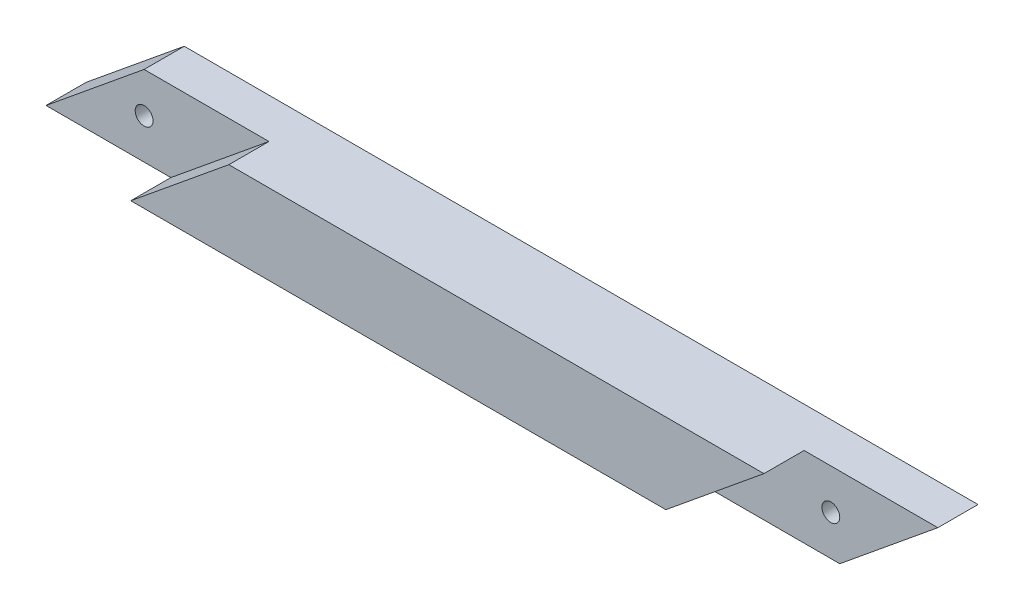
ISO-10303-21;
HEADER;
FILE_DESCRIPTION(('STEP AP214'),'2;1');
FILE_NAME('part.step','',(''),(''),'','','');
FILE_SCHEMA(('AUTOMOTIVE_DESIGN { 1 0 10303 214 1 1 1 1 }'));
ENDSEC;
DATA;
#1=APPLICATION_CONTEXT('core data for automotive mechanical design processes');
#2=APPLICATION_PROTOCOL_DEFINITION('international standard','automotive_design',2000,#1);
#3=PRODUCT_CONTEXT('',#1,'mechanical');
#4=PRODUCT('Part','Part','',(#3));
#5=PRODUCT_RELATED_PRODUCT_CATEGORY('part','',(#4));
#6=PRODUCT_DEFINITION_FORMATION('','',#4);
#7=PRODUCT_DEFINITION_CONTEXT('part definition',#1,'design');
#8=PRODUCT_DEFINITION('design','',#6,#7);
#9=PRODUCT_DEFINITION_SHAPE('','',#8);
#10=(LENGTH_UNIT() NAMED_UNIT(*) SI_UNIT(.MILLI.,.METRE.));
#11=(NAMED_UNIT(*) PLANE_ANGLE_UNIT() SI_UNIT($,.RADIAN.));
#12=(NAMED_UNIT(*) SI_UNIT($,.STERADIAN.) SOLID_ANGLE_UNIT());
#13=UNCERTAINTY_MEASURE_WITH_UNIT(LENGTH_MEASURE(1.E-05),#10,'distance_accuracy_value','');
#14=(GEOMETRIC_REPRESENTATION_CONTEXT(3) GLOBAL_UNCERTAINTY_ASSIGNED_CONTEXT((#13)) GLOBAL_UNIT_ASSIGNED_CONTEXT((#10,
#11,#12)) REPRESENTATION_CONTEXT('',''));
#15=CARTESIAN_POINT('',(0.,0.,0.));
#16=DIRECTION('',(0.,0.,1.));
#17=DIRECTION('',(1.,0.,0.));
#18=AXIS2_PLACEMENT_3D('',#15,#16,#17);
#19=CARTESIAN_POINT('',(100.,9.,0.));
#20=DIRECTION('',(-0.633237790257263,0.773957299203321,0.));
#21=DIRECTION('',(-0.773957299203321,-0.633237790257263,0.));
#22=AXIS2_PLACEMENT_3D('',#19,#20,#21);
#23=PLANE('',#22);
#24=DIRECTION('',(0.773957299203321,0.633237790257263,0.));
#25=VECTOR('',#24,1.);
#26=CARTESIAN_POINT('',(89.,0.,4.5));
#27=LINE('',#26,#25);
#28=CARTESIAN_POINT('',(89.,0.,4.5));
#29=VERTEX_POINT('',#28);
#30=CARTESIAN_POINT('',(100.,9.,4.5));
#31=VERTEX_POINT('',#30);
#32=EDGE_CURVE('E95',#29,#31,#27,.T.);
#33=ORIENTED_EDGE('',*,*,#32,.F.);
#34=DIRECTION('',(0.,0.,1.));
#35=VECTOR('',#34,1.);
#36=CARTESIAN_POINT('',(89.,0.,0.));
#37=LINE('',#36,#35);
#38=CARTESIAN_POINT('',(89.,0.,0.));
#39=VERTEX_POINT('',#38);
#40=EDGE_CURVE('E153',#39,#29,#37,.T.);
#41=ORIENTED_EDGE('',*,*,#40,.F.);
#42=DIRECTION('',(-0.773957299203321,-0.633237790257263,0.));
#43=VECTOR('',#42,1.);
#44=CARTESIAN_POINT('',(100.,9.,0.));
#45=LINE('',#44,#43);
#46=CARTESIAN_POINT('',(100.,9.,0.));
#47=VERTEX_POINT('',#46);
#48=EDGE_CURVE('E114',#47,#39,#45,.T.);
#49=ORIENTED_EDGE('',*,*,#48,.F.);
#50=DIRECTION('',(0.,0.,-1.));
#51=VECTOR('',#50,1.);
#52=CARTESIAN_POINT('',(100.,9.,9.));
#53=LINE('',#52,#51);
#54=EDGE_CURVE('E39',#31,#47,#53,.T.);
#55=ORIENTED_EDGE('',*,*,#54,.F.);
#56=EDGE_LOOP('',(#33,#41,#49,#55));
#57=FACE_BOUND('',#56,.T.);
#58=ADVANCED_FACE('F31',(#57),#23,.F.);
#59=CARTESIAN_POINT('',(0.,9.,9.));
#60=DIRECTION('',(0.,-1.,0.));
#61=DIRECTION('',(0.,0.,-1.));
#62=AXIS2_PLACEMENT_3D('',#59,#60,#61);
#63=PLANE('',#62);
#64=DIRECTION('',(-1.,0.,0.));
#65=VECTOR('',#64,1.);
#66=CARTESIAN_POINT('',(0.,9.,9.));
#67=LINE('',#66,#65);
#68=CARTESIAN_POINT('',(85.,9.,9.));
#69=VERTEX_POINT('',#68);
#70=CARTESIAN_POINT('',(25.,9.,9.));
#71=VERTEX_POINT('',#70);
#72=EDGE_CURVE('E116',#69,#71,#67,.T.);
#73=ORIENTED_EDGE('',*,*,#72,.F.);
#74=DIRECTION('',(0.,0.,1.));
#75=VECTOR('',#74,1.);
#76=CARTESIAN_POINT('',(85.,9.,4.5));
#77=LINE('',#76,#75);
#78=CARTESIAN_POINT('',(85.,9.,4.5));
#79=VERTEX_POINT('',#78);
#80=EDGE_CURVE('E110',#79,#69,#77,.T.);
#81=ORIENTED_EDGE('',*,*,#80,.F.);
#82=DIRECTION('',(-1.,0.,0.));
#83=VECTOR('',#82,1.);
#84=CARTESIAN_POINT('',(100.,9.,4.5));
#85=LINE('',#84,#83);
#86=EDGE_CURVE('E98',#31,#79,#85,.T.);
#87=ORIENTED_EDGE('',*,*,#86,.F.);
#88=ORIENTED_EDGE('',*,*,#54,.T.);
#89=DIRECTION('',(-1.,0.,0.));
#90=VECTOR('',#89,1.);
#91=CARTESIAN_POINT('',(0.,9.,0.));
#92=LINE('',#91,#90);
#93=CARTESIAN_POINT('',(11.,9.,0.));
#94=VERTEX_POINT('',#93);
#95=EDGE_CURVE('E120',#47,#94,#92,.T.);
#96=ORIENTED_EDGE('',*,*,#95,.T.);
#97=DIRECTION('',(0.,0.,1.));
#98=VECTOR('',#97,1.);
#99=CARTESIAN_POINT('',(11.,9.,0.));
#100=LINE('',#99,#98);
#101=CARTESIAN_POINT('',(11.,9.,4.5));
#102=VERTEX_POINT('',#101);
#103=EDGE_CURVE('E124',#94,#102,#100,.T.);
#104=ORIENTED_EDGE('',*,*,#103,.T.);
#105=DIRECTION('',(-1.,0.,0.));
#106=VECTOR('',#105,1.);
#107=CARTESIAN_POINT('',(11.,9.,4.5));
#108=LINE('',#107,#106);
#109=CARTESIAN_POINT('',(25.,9.,4.5));
#110=VERTEX_POINT('',#109);
#111=EDGE_CURVE('E54',#110,#102,#108,.T.);
#112=ORIENTED_EDGE('',*,*,#111,.F.);
#113=DIRECTION('',(0.,0.,1.));
#114=VECTOR('',#113,1.);
#115=CARTESIAN_POINT('',(25.,9.,4.5));
#116=LINE('',#115,#114);
#117=EDGE_CURVE('E133',#110,#71,#116,.T.);
#118=ORIENTED_EDGE('',*,*,#117,.T.);
#119=EDGE_LOOP('',(#73,#81,#87,#88,#96,#104,#112,#118));
#120=FACE_BOUND('',#119,.T.);
#121=ADVANCED_FACE('F107',(#120),#63,.F.);
#122=CARTESIAN_POINT('',(0.,9.,9.));
#123=DIRECTION('',(0.,0.,-1.));
#124=DIRECTION('',(-1.,0.,0.));
#125=AXIS2_PLACEMENT_3D('',#122,#123,#124);
#126=PLANE('',#125);
#127=DIRECTION('',(1.,0.,0.));
#128=VECTOR('',#127,1.);
#129=CARTESIAN_POINT('',(0.,0.,9.));
#130=LINE('',#129,#128);
#131=CARTESIAN_POINT('',(14.,0.,9.));
#132=VERTEX_POINT('',#131);
#133=CARTESIAN_POINT('',(74.,0.,9.));
#134=VERTEX_POINT('',#133);
#135=EDGE_CURVE('E117',#132,#134,#130,.T.);
#136=ORIENTED_EDGE('',*,*,#135,.T.);
#137=DIRECTION('',(-0.773957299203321,-0.633237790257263,0.));
#138=VECTOR('',#137,1.);
#139=CARTESIAN_POINT('',(85.,9.,9.));
#140=LINE('',#139,#138);
#141=EDGE_CURVE('E103',#69,#134,#140,.T.);
#142=ORIENTED_EDGE('',*,*,#141,.F.);
#143=ORIENTED_EDGE('',*,*,#72,.T.);
#144=DIRECTION('',(0.773957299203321,0.633237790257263,0.));
#145=VECTOR('',#144,1.);
#146=CARTESIAN_POINT('',(25.,9.,9.));
#147=LINE('',#146,#145);
#148=EDGE_CURVE('E138',#132,#71,#147,.T.);
#149=ORIENTED_EDGE('',*,*,#148,.F.);
#150=EDGE_LOOP('',(#136,#142,#143,#149));
#151=FACE_BOUND('',#150,.T.);
#152=ADVANCED_FACE('F195',(#151),#126,.F.);
#153=CARTESIAN_POINT('',(0.,9.,0.));
#154=DIRECTION('',(0.,0.,-1.));
#155=DIRECTION('',(-1.,0.,0.));
#156=AXIS2_PLACEMENT_3D('',#153,#154,#155);
#157=PLANE('',#156);
#158=CARTESIAN_POINT('',(88.,4.5,0.));
#159=DIRECTION('',(0.,0.,1.));
#160=DIRECTION('',(1.,0.,0.));
#161=AXIS2_PLACEMENT_3D('',#158,#159,#160);
#162=CIRCLE('',#161,0.999999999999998);
#163=CARTESIAN_POINT('',(89.,4.5,0.));
#164=VERTEX_POINT('',#163);
#165=EDGE_CURVE('E163',#164,#164,#162,.T.);
#166=ORIENTED_EDGE('',*,*,#165,.T.);
#167=EDGE_LOOP('',(#166));
#168=FACE_BOUND('',#167,.T.);
#169=ORIENTED_EDGE('',*,*,#48,.T.);
#170=DIRECTION('',(1.,0.,0.));
#171=VECTOR('',#170,1.);
#172=CARTESIAN_POINT('',(0.,0.,0.));
#173=LINE('',#172,#171);
#174=CARTESIAN_POINT('',(0.,0.,0.));
#175=VERTEX_POINT('',#174);
#176=EDGE_CURVE('E122',#175,#39,#173,.T.);
#177=ORIENTED_EDGE('',*,*,#176,.F.);
#178=DIRECTION('',(-0.773957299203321,-0.633237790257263,0.));
#179=VECTOR('',#178,1.);
#180=CARTESIAN_POINT('',(-34.480988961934,-28.2117182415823,0.));
#181=LINE('',#180,#179);
#182=EDGE_CURVE('E130',#94,#175,#181,.T.);
#183=ORIENTED_EDGE('',*,*,#182,.F.);
#184=ORIENTED_EDGE('',*,*,#95,.F.);
#185=EDGE_LOOP('',(#169,#177,#183,#184));
#186=FACE_BOUND('',#185,.T.);
#187=CARTESIAN_POINT('',(11.,4.5,0.));
#188=DIRECTION('',(0.,0.,1.));
#189=DIRECTION('',(1.,0.,0.));
#190=AXIS2_PLACEMENT_3D('',#187,#188,#189);
#191=CIRCLE('',#190,1.);
#192=CARTESIAN_POINT('',(12.,4.5,0.));
#193=VERTEX_POINT('',#192);
#194=EDGE_CURVE('E142',#193,#193,#191,.T.);
#195=ORIENTED_EDGE('',*,*,#194,.T.);
#196=EDGE_LOOP('',(#195));
#197=FACE_BOUND('',#196,.T.);
#198=ADVANCED_FACE('F172',(#168,#186,#197),#157,.T.);
#199=CARTESIAN_POINT('',(0.,0.,9.));
#200=DIRECTION('',(0.,1.,0.));
#201=DIRECTION('',(0.,0.,1.));
#202=AXIS2_PLACEMENT_3D('',#199,#200,#201);
#203=PLANE('',#202);
#204=DIRECTION('',(1.,0.,0.));
#205=VECTOR('',#204,1.);
#206=CARTESIAN_POINT('',(74.,0.,4.5));
#207=LINE('',#206,#205);
#208=CARTESIAN_POINT('',(74.,0.,4.5));
#209=VERTEX_POINT('',#208);
#210=EDGE_CURVE('E46',#209,#29,#207,.T.);
#211=ORIENTED_EDGE('',*,*,#210,.F.);
#212=DIRECTION('',(0.,0.,1.));
#213=VECTOR('',#212,1.);
#214=CARTESIAN_POINT('',(74.,0.,4.5));
#215=LINE('',#214,#213);
#216=EDGE_CURVE('E158',#209,#134,#215,.T.);
#217=ORIENTED_EDGE('',*,*,#216,.T.);
#218=ORIENTED_EDGE('',*,*,#135,.F.);
#219=DIRECTION('',(0.,0.,1.));
#220=VECTOR('',#219,1.);
#221=CARTESIAN_POINT('',(14.,0.,4.5));
#222=LINE('',#221,#220);
#223=CARTESIAN_POINT('',(14.,0.,4.5));
#224=VERTEX_POINT('',#223);
#225=EDGE_CURVE('E134',#224,#132,#222,.T.);
#226=ORIENTED_EDGE('',*,*,#225,.F.);
#227=DIRECTION('',(1.,0.,0.));
#228=VECTOR('',#227,1.);
#229=CARTESIAN_POINT('',(14.,0.,4.5));
#230=LINE('',#229,#228);
#231=CARTESIAN_POINT('',(0.,0.,4.5));
#232=VERTEX_POINT('',#231);
#233=EDGE_CURVE('E146',#232,#224,#230,.T.);
#234=ORIENTED_EDGE('',*,*,#233,.F.);
#235=DIRECTION('',(0.,0.,-1.));
#236=VECTOR('',#235,1.);
#237=CARTESIAN_POINT('',(0.,0.,9.));
#238=LINE('',#237,#236);
#239=EDGE_CURVE('E11',#232,#175,#238,.T.);
#240=ORIENTED_EDGE('',*,*,#239,.T.);
#241=ORIENTED_EDGE('',*,*,#176,.T.);
#242=ORIENTED_EDGE('',*,*,#40,.T.);
#243=EDGE_LOOP('',(#211,#217,#218,#226,#234,#240,#241,#242));
#244=FACE_BOUND('',#243,.T.);
#245=ADVANCED_FACE('F33',(#244),#203,.F.);
#246=CARTESIAN_POINT('',(-34.480988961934,-28.2117182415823,0.));
#247=DIRECTION('',(-0.633237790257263,0.773957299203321,0.));
#248=DIRECTION('',(-0.773957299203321,-0.633237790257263,0.));
#249=AXIS2_PLACEMENT_3D('',#246,#247,#248);
#250=PLANE('',#249);
#251=DIRECTION('',(-0.773957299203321,-0.633237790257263,0.));
#252=VECTOR('',#251,1.);
#253=CARTESIAN_POINT('',(0.,0.,4.5));
#254=LINE('',#253,#252);
#255=EDGE_CURVE('E141',#102,#232,#254,.T.);
#256=ORIENTED_EDGE('',*,*,#255,.F.);
#257=ORIENTED_EDGE('',*,*,#103,.F.);
#258=ORIENTED_EDGE('',*,*,#182,.T.);
#259=ORIENTED_EDGE('',*,*,#239,.F.);
#260=EDGE_LOOP('',(#256,#257,#258,#259));
#261=FACE_BOUND('',#260,.T.);
#262=ADVANCED_FACE('F207',(#261),#250,.T.);
#263=CARTESIAN_POINT('',(25.,9.,4.5));
#264=DIRECTION('',(0.633237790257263,-0.773957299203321,0.));
#265=DIRECTION('',(0.773957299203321,0.633237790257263,0.));
#266=AXIS2_PLACEMENT_3D('',#263,#264,#265);
#267=PLANE('',#266);
#268=ORIENTED_EDGE('',*,*,#148,.T.);
#269=ORIENTED_EDGE('',*,*,#117,.F.);
#270=DIRECTION('',(0.773957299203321,0.633237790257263,0.));
#271=VECTOR('',#270,1.);
#272=CARTESIAN_POINT('',(25.,9.,4.5));
#273=LINE('',#272,#271);
#274=EDGE_CURVE('E144',#224,#110,#273,.T.);
#275=ORIENTED_EDGE('',*,*,#274,.F.);
#276=ORIENTED_EDGE('',*,*,#225,.T.);
#277=EDGE_LOOP('',(#268,#269,#275,#276));
#278=FACE_BOUND('',#277,.T.);
#279=ADVANCED_FACE('F203',(#278),#267,.F.);
#280=CARTESIAN_POINT('',(11.,9.,4.5));
#281=DIRECTION('',(0.,0.,-1.));
#282=DIRECTION('',(-1.,0.,0.));
#283=AXIS2_PLACEMENT_3D('',#280,#281,#282);
#284=PLANE('',#283);
#285=CARTESIAN_POINT('',(11.,4.5,4.5));
#286=DIRECTION('',(0.,0.,1.));
#287=DIRECTION('',(1.,0.,0.));
#288=AXIS2_PLACEMENT_3D('',#285,#286,#287);
#289=CIRCLE('',#288,1.);
#290=CARTESIAN_POINT('',(12.,4.5,4.5));
#291=VERTEX_POINT('',#290);
#292=EDGE_CURVE('E150',#291,#291,#289,.T.);
#293=ORIENTED_EDGE('',*,*,#292,.F.);
#294=EDGE_LOOP('',(#293));
#295=FACE_BOUND('',#294,.T.);
#296=ORIENTED_EDGE('',*,*,#255,.T.);
#297=ORIENTED_EDGE('',*,*,#233,.T.);
#298=ORIENTED_EDGE('',*,*,#274,.T.);
#299=ORIENTED_EDGE('',*,*,#111,.T.);
#300=EDGE_LOOP('',(#296,#297,#298,#299));
#301=FACE_BOUND('',#300,.T.);
#302=ADVANCED_FACE('F199',(#295,#301),#284,.F.);
#303=CARTESIAN_POINT('',(11.,4.5,0.));
#304=DIRECTION('',(0.,0.,1.));
#305=DIRECTION('',(1.,0.,0.));
#306=AXIS2_PLACEMENT_3D('',#303,#304,#305);
#307=CYLINDRICAL_SURFACE('',#306,1.);
#308=ORIENTED_EDGE('',*,*,#194,.F.);
#309=EDGE_LOOP('',(#308));
#310=FACE_BOUND('',#309,.T.);
#311=ORIENTED_EDGE('',*,*,#292,.T.);
#312=EDGE_LOOP('',(#311));
#313=FACE_BOUND('',#312,.T.);
#314=ADVANCED_FACE('F187',(#310,#313),#307,.F.);
#315=CARTESIAN_POINT('',(85.,9.,4.5));
#316=DIRECTION('',(-0.633237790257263,0.77395729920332,0.));
#317=DIRECTION('',(-0.773957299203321,-0.633237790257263,0.));
#318=AXIS2_PLACEMENT_3D('',#315,#316,#317);
#319=PLANE('',#318);
#320=ORIENTED_EDGE('',*,*,#141,.T.);
#321=ORIENTED_EDGE('',*,*,#216,.F.);
#322=DIRECTION('',(-0.773957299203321,-0.633237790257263,0.));
#323=VECTOR('',#322,1.);
#324=CARTESIAN_POINT('',(85.,9.,4.5));
#325=LINE('',#324,#323);
#326=EDGE_CURVE('E111',#79,#209,#325,.T.);
#327=ORIENTED_EDGE('',*,*,#326,.F.);
#328=ORIENTED_EDGE('',*,*,#80,.T.);
#329=EDGE_LOOP('',(#320,#321,#327,#328));
#330=FACE_BOUND('',#329,.T.);
#331=ADVANCED_FACE('F182',(#330),#319,.F.);
#332=CARTESIAN_POINT('',(100.,9.,4.5));
#333=DIRECTION('',(0.,0.,1.));
#334=DIRECTION('',(1.,0.,0.));
#335=AXIS2_PLACEMENT_3D('',#332,#333,#334);
#336=PLANE('',#335);
#337=CARTESIAN_POINT('',(88.,4.5,4.5));
#338=DIRECTION('',(0.,0.,1.));
#339=DIRECTION('',(1.,0.,0.));
#340=AXIS2_PLACEMENT_3D('',#337,#338,#339);
#341=CIRCLE('',#340,0.999999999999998);
#342=CARTESIAN_POINT('',(89.,4.5,4.5));
#343=VERTEX_POINT('',#342);
#344=EDGE_CURVE('E166',#343,#343,#341,.T.);
#345=ORIENTED_EDGE('',*,*,#344,.F.);
#346=EDGE_LOOP('',(#345));
#347=FACE_BOUND('',#346,.T.);
#348=ORIENTED_EDGE('',*,*,#32,.T.);
#349=ORIENTED_EDGE('',*,*,#86,.T.);
#350=ORIENTED_EDGE('',*,*,#326,.T.);
#351=ORIENTED_EDGE('',*,*,#210,.T.);
#352=EDGE_LOOP('',(#348,#349,#350,#351));
#353=FACE_BOUND('',#352,.T.);
#354=ADVANCED_FACE('F97',(#347,#353),#336,.T.);
#355=CARTESIAN_POINT('',(88.,4.5,0.));
#356=DIRECTION('',(0.,0.,1.));
#357=DIRECTION('',(1.,0.,0.));
#358=AXIS2_PLACEMENT_3D('',#355,#356,#357);
#359=CYLINDRICAL_SURFACE('',#358,0.999999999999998);
#360=ORIENTED_EDGE('',*,*,#165,.F.);
#361=EDGE_LOOP('',(#360));
#362=FACE_BOUND('',#361,.T.);
#363=ORIENTED_EDGE('',*,*,#344,.T.);
#364=EDGE_LOOP('',(#363));
#365=FACE_BOUND('',#364,.T.);
#366=ADVANCED_FACE('F175',(#362,#365),#359,.F.);
#367=CLOSED_SHELL('',(#58,#121,#152,#198,#245,#262,#279,#302,#314,#331,#354,#366));
#368=MANIFOLD_SOLID_BREP('B2',#367);
#369=ADVANCED_BREP_SHAPE_REPRESENTATION('',(#18,#368),#14);
#370=SHAPE_DEFINITION_REPRESENTATION(#9,#369);
ENDSEC;
END-ISO-10303-21;
